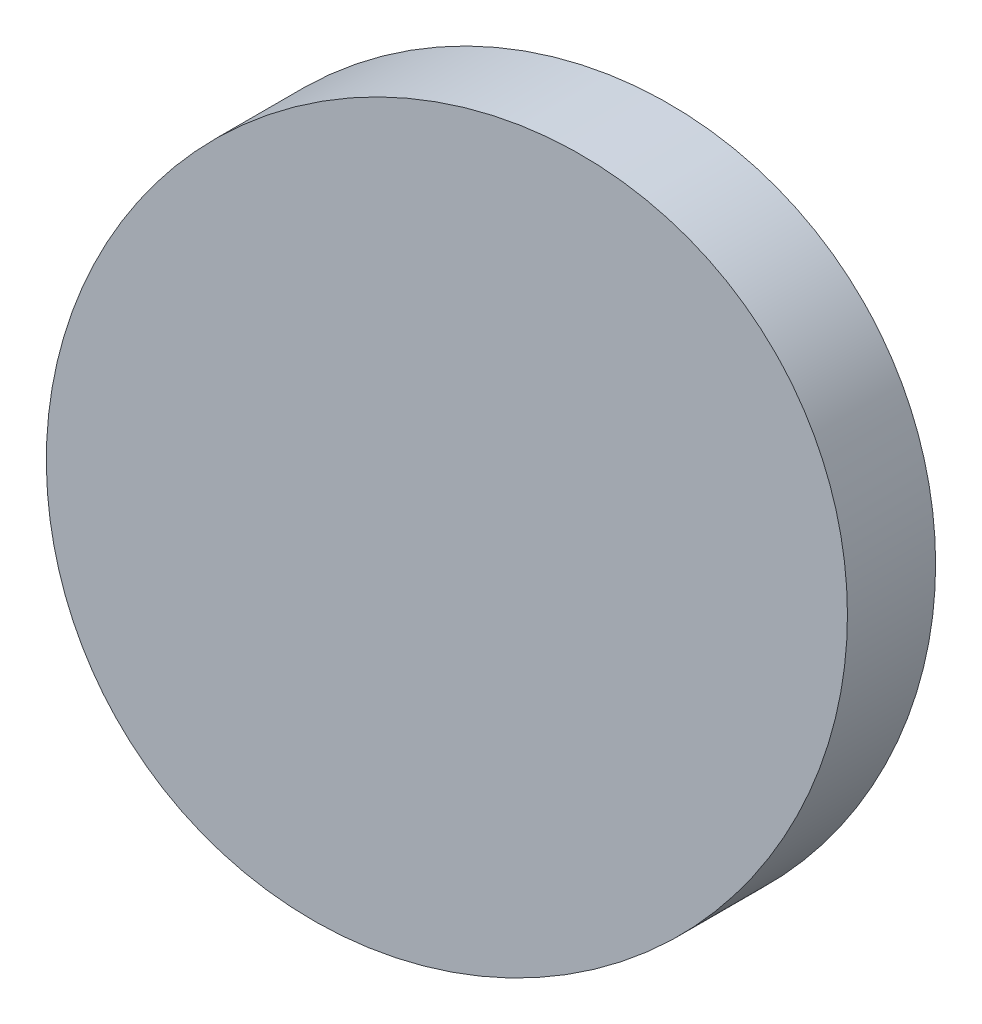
ISO-10303-21;
HEADER;
FILE_DESCRIPTION(('STEP AP214'),'2;1');
FILE_NAME('part.step','',(''),(''),'','','');
FILE_SCHEMA(('AUTOMOTIVE_DESIGN { 1 0 10303 214 1 1 1 1 }'));
ENDSEC;
DATA;
#1=APPLICATION_CONTEXT('core data for automotive mechanical design processes');
#2=APPLICATION_PROTOCOL_DEFINITION('international standard','automotive_design',2000,#1);
#3=PRODUCT_CONTEXT('',#1,'mechanical');
#4=PRODUCT('Part','Part','',(#3));
#5=PRODUCT_RELATED_PRODUCT_CATEGORY('part','',(#4));
#6=PRODUCT_DEFINITION_FORMATION('','',#4);
#7=PRODUCT_DEFINITION_CONTEXT('part definition',#1,'design');
#8=PRODUCT_DEFINITION('design','',#6,#7);
#9=PRODUCT_DEFINITION_SHAPE('','',#8);
#10=(LENGTH_UNIT() NAMED_UNIT(*) SI_UNIT(.MILLI.,.METRE.));
#11=(NAMED_UNIT(*) PLANE_ANGLE_UNIT() SI_UNIT($,.RADIAN.));
#12=(NAMED_UNIT(*) SI_UNIT($,.STERADIAN.) SOLID_ANGLE_UNIT());
#13=UNCERTAINTY_MEASURE_WITH_UNIT(LENGTH_MEASURE(1.E-05),#10,'distance_accuracy_value','');
#14=(GEOMETRIC_REPRESENTATION_CONTEXT(3) GLOBAL_UNCERTAINTY_ASSIGNED_CONTEXT((#13)) GLOBAL_UNIT_ASSIGNED_CONTEXT((#10,
#11,#12)) REPRESENTATION_CONTEXT('',''));
#15=CARTESIAN_POINT('',(0.,0.,0.));
#16=DIRECTION('',(0.,0.,1.));
#17=DIRECTION('',(1.,0.,0.));
#18=AXIS2_PLACEMENT_3D('',#15,#16,#17);
#19=CARTESIAN_POINT('',(-12.1748856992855,-6.1402752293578,10.));
#20=DIRECTION('',(0.,0.,1.));
#21=DIRECTION('',(0.712443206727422,0.70172977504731,0.));
#22=AXIS2_PLACEMENT_3D('',#19,#20,#21);
#23=ELLIPSE('',#22,52.3445032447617,36.9766477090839);
#24=DIRECTION('',(0.,0.,-1.));
#25=VECTOR('',#24,1.);
#26=SURFACE_OF_LINEAR_EXTRUSION('',#23,#25);
#27=CARTESIAN_POINT('',(25.1176000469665,30.591421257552,10.));
#28=VERTEX_POINT('',#27);
#29=EDGE_CURVE('E10',#28,#28,#23,.T.);
#30=ORIENTED_EDGE('',*,*,#29,.F.);
#31=EDGE_LOOP('',(#30));
#32=FACE_BOUND('',#31,.T.);
#33=CARTESIAN_POINT('',(-12.1748856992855,-6.1402752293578,0.));
#34=DIRECTION('',(0.,0.,1.));
#35=DIRECTION('',(0.712443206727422,0.70172977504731,0.));
#36=AXIS2_PLACEMENT_3D('',#33,#34,#35);
#37=ELLIPSE('',#36,52.3445032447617,36.9766477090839);
#38=CARTESIAN_POINT('',(25.1176000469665,30.591421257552,0.));
#39=VERTEX_POINT('',#38);
#40=EDGE_CURVE('E40',#39,#39,#37,.T.);
#41=ORIENTED_EDGE('',*,*,#40,.T.);
#42=EDGE_LOOP('',(#41));
#43=FACE_BOUND('',#42,.T.);
#44=ADVANCED_FACE('F36',(#32,#43),#26,.F.);
#45=CARTESIAN_POINT('',(-12.1748856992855,-6.1402752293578,10.));
#46=DIRECTION('',(0.,0.,1.));
#47=DIRECTION('',(1.,0.,0.));
#48=AXIS2_PLACEMENT_3D('',#45,#46,#47);
#49=PLANE('',#48);
#50=ORIENTED_EDGE('',*,*,#29,.T.);
#51=EDGE_LOOP('',(#50));
#52=FACE_BOUND('',#51,.T.);
#53=ADVANCED_FACE('F52',(#52),#49,.T.);
#54=CARTESIAN_POINT('',(-12.1748856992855,-6.1402752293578,0.));
#55=DIRECTION('',(0.,0.,1.));
#56=DIRECTION('',(1.,0.,0.));
#57=AXIS2_PLACEMENT_3D('',#54,#55,#56);
#58=PLANE('',#57);
#59=ORIENTED_EDGE('',*,*,#40,.F.);
#60=EDGE_LOOP('',(#59));
#61=FACE_BOUND('',#60,.T.);
#62=ADVANCED_FACE('F50',(#61),#58,.F.);
#63=CLOSED_SHELL('',(#44,#53,#62));
#64=MANIFOLD_SOLID_BREP('B2',#63);
#65=ADVANCED_BREP_SHAPE_REPRESENTATION('',(#18,#64),#14);
#66=SHAPE_DEFINITION_REPRESENTATION(#9,#65);
ENDSEC;
END-ISO-10303-21;
